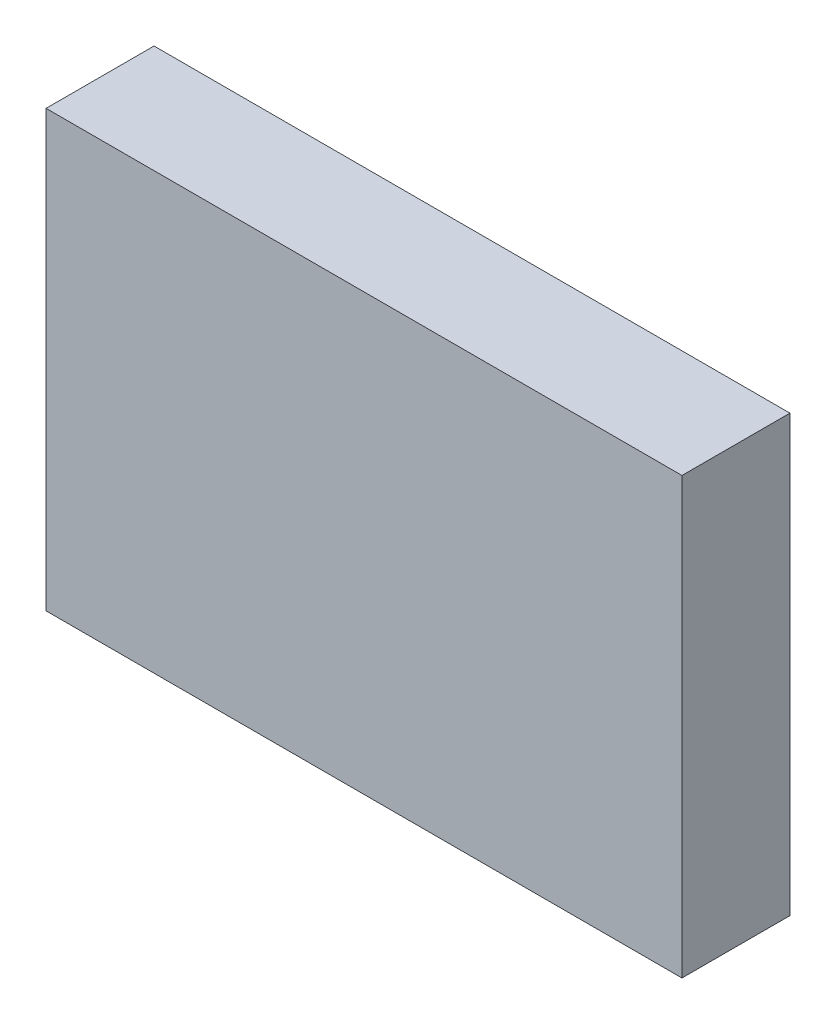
ISO-10303-21;
HEADER;
FILE_DESCRIPTION(('STEP AP214'),'2;1');
FILE_NAME('part.step','',(''),(''),'','','');
FILE_SCHEMA(('AUTOMOTIVE_DESIGN { 1 0 10303 214 1 1 1 1 }'));
ENDSEC;
DATA;
#1=APPLICATION_CONTEXT('core data for automotive mechanical design processes');
#2=APPLICATION_PROTOCOL_DEFINITION('international standard','automotive_design',2000,#1);
#3=PRODUCT_CONTEXT('',#1,'mechanical');
#4=PRODUCT('Part','Part','',(#3));
#5=PRODUCT_RELATED_PRODUCT_CATEGORY('part','',(#4));
#6=PRODUCT_DEFINITION_FORMATION('','',#4);
#7=PRODUCT_DEFINITION_CONTEXT('part definition',#1,'design');
#8=PRODUCT_DEFINITION('design','',#6,#7);
#9=PRODUCT_DEFINITION_SHAPE('','',#8);
#10=(LENGTH_UNIT() NAMED_UNIT(*) SI_UNIT(.MILLI.,.METRE.));
#11=(NAMED_UNIT(*) PLANE_ANGLE_UNIT() SI_UNIT($,.RADIAN.));
#12=(NAMED_UNIT(*) SI_UNIT($,.STERADIAN.) SOLID_ANGLE_UNIT());
#13=UNCERTAINTY_MEASURE_WITH_UNIT(LENGTH_MEASURE(1.E-05),#10,'distance_accuracy_value','');
#14=(GEOMETRIC_REPRESENTATION_CONTEXT(3) GLOBAL_UNCERTAINTY_ASSIGNED_CONTEXT((#13)) GLOBAL_UNIT_ASSIGNED_CONTEXT((#10,
#11,#12)) REPRESENTATION_CONTEXT('',''));
#15=CARTESIAN_POINT('',(0.,0.,0.));
#16=DIRECTION('',(0.,0.,1.));
#17=DIRECTION('',(1.,0.,0.));
#18=AXIS2_PLACEMENT_3D('',#15,#16,#17);
#19=CARTESIAN_POINT('',(-43.2247925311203,28.4432572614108,10.));
#20=DIRECTION('',(1.,0.,0.));
#21=DIRECTION('',(0.,0.,-1.));
#22=AXIS2_PLACEMENT_3D('',#19,#20,#21);
#23=PLANE('',#22);
#24=DIRECTION('',(0.,-1.,0.));
#25=VECTOR('',#24,1.);
#26=CARTESIAN_POINT('',(-43.2247925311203,28.4432572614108,0.));
#27=LINE('',#26,#25);
#28=CARTESIAN_POINT('',(-43.2247925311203,28.4432572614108,0.));
#29=VERTEX_POINT('',#28);
#30=CARTESIAN_POINT('',(-43.2247925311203,-11.870020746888,0.));
#31=VERTEX_POINT('',#30);
#32=EDGE_CURVE('E76',#29,#31,#27,.T.);
#33=ORIENTED_EDGE('',*,*,#32,.T.);
#34=DIRECTION('',(0.,0.,-1.));
#35=VECTOR('',#34,1.);
#36=CARTESIAN_POINT('',(-43.2247925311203,-11.870020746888,10.));
#37=LINE('',#36,#35);
#38=CARTESIAN_POINT('',(-43.2247925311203,-11.870020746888,10.));
#39=VERTEX_POINT('',#38);
#40=EDGE_CURVE('E11',#39,#31,#37,.T.);
#41=ORIENTED_EDGE('',*,*,#40,.F.);
#42=DIRECTION('',(0.,-1.,0.));
#43=VECTOR('',#42,1.);
#44=CARTESIAN_POINT('',(-43.2247925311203,28.4432572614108,10.));
#45=LINE('',#44,#43);
#46=CARTESIAN_POINT('',(-43.2247925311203,28.4432572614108,10.));
#47=VERTEX_POINT('',#46);
#48=EDGE_CURVE('E94',#47,#39,#45,.T.);
#49=ORIENTED_EDGE('',*,*,#48,.F.);
#50=DIRECTION('',(0.,0.,-1.));
#51=VECTOR('',#50,1.);
#52=CARTESIAN_POINT('',(-43.2247925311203,28.4432572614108,10.));
#53=LINE('',#52,#51);
#54=EDGE_CURVE('E88',#47,#29,#53,.T.);
#55=ORIENTED_EDGE('',*,*,#54,.T.);
#56=EDGE_LOOP('',(#33,#41,#49,#55));
#57=FACE_BOUND('',#56,.T.);
#58=ADVANCED_FACE('F32',(#57),#23,.F.);
#59=CARTESIAN_POINT('',(-43.2247925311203,-11.870020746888,10.));
#60=DIRECTION('',(0.,1.,0.));
#61=DIRECTION('',(0.,0.,1.));
#62=AXIS2_PLACEMENT_3D('',#59,#60,#61);
#63=PLANE('',#62);
#64=DIRECTION('',(1.,0.,0.));
#65=VECTOR('',#64,1.);
#66=CARTESIAN_POINT('',(-43.2247925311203,-11.870020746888,0.));
#67=LINE('',#66,#65);
#68=CARTESIAN_POINT('',(15.6773858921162,-11.870020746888,0.));
#69=VERTEX_POINT('',#68);
#70=EDGE_CURVE('E72',#31,#69,#67,.T.);
#71=ORIENTED_EDGE('',*,*,#70,.T.);
#72=DIRECTION('',(0.,0.,-1.));
#73=VECTOR('',#72,1.);
#74=CARTESIAN_POINT('',(15.6773858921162,-11.870020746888,10.));
#75=LINE('',#74,#73);
#76=CARTESIAN_POINT('',(15.6773858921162,-11.870020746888,10.));
#77=VERTEX_POINT('',#76);
#78=EDGE_CURVE('E39',#77,#69,#75,.T.);
#79=ORIENTED_EDGE('',*,*,#78,.F.);
#80=DIRECTION('',(1.,0.,0.));
#81=VECTOR('',#80,1.);
#82=CARTESIAN_POINT('',(-43.2247925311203,-11.870020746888,10.));
#83=LINE('',#82,#81);
#84=EDGE_CURVE('E84',#39,#77,#83,.T.);
#85=ORIENTED_EDGE('',*,*,#84,.F.);
#86=ORIENTED_EDGE('',*,*,#40,.T.);
#87=EDGE_LOOP('',(#71,#79,#85,#86));
#88=FACE_BOUND('',#87,.T.);
#89=ADVANCED_FACE('F83',(#88),#63,.F.);
#90=CARTESIAN_POINT('',(15.6773858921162,28.4432572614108,10.));
#91=DIRECTION('',(-1.,0.,0.));
#92=DIRECTION('',(0.,0.,1.));
#93=AXIS2_PLACEMENT_3D('',#90,#91,#92);
#94=PLANE('',#93);
#95=DIRECTION('',(0.,1.,0.));
#96=VECTOR('',#95,1.);
#97=CARTESIAN_POINT('',(15.6773858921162,28.4432572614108,0.));
#98=LINE('',#97,#96);
#99=CARTESIAN_POINT('',(15.6773858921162,28.4432572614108,0.));
#100=VERTEX_POINT('',#99);
#101=EDGE_CURVE('E77',#69,#100,#98,.T.);
#102=ORIENTED_EDGE('',*,*,#101,.T.);
#103=DIRECTION('',(0.,0.,-1.));
#104=VECTOR('',#103,1.);
#105=CARTESIAN_POINT('',(15.6773858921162,28.4432572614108,10.));
#106=LINE('',#105,#104);
#107=CARTESIAN_POINT('',(15.6773858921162,28.4432572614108,10.));
#108=VERTEX_POINT('',#107);
#109=EDGE_CURVE('E100',#108,#100,#106,.T.);
#110=ORIENTED_EDGE('',*,*,#109,.F.);
#111=DIRECTION('',(0.,1.,0.));
#112=VECTOR('',#111,1.);
#113=CARTESIAN_POINT('',(15.6773858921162,28.4432572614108,10.));
#114=LINE('',#113,#112);
#115=EDGE_CURVE('E51',#77,#108,#114,.T.);
#116=ORIENTED_EDGE('',*,*,#115,.F.);
#117=ORIENTED_EDGE('',*,*,#78,.T.);
#118=EDGE_LOOP('',(#102,#110,#116,#117));
#119=FACE_BOUND('',#118,.T.);
#120=ADVANCED_FACE('F103',(#119),#94,.F.);
#121=CARTESIAN_POINT('',(-43.2247925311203,28.4432572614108,10.));
#122=DIRECTION('',(0.,-1.,0.));
#123=DIRECTION('',(0.,0.,-1.));
#124=AXIS2_PLACEMENT_3D('',#121,#122,#123);
#125=PLANE('',#124);
#126=DIRECTION('',(-1.,0.,0.));
#127=VECTOR('',#126,1.);
#128=CARTESIAN_POINT('',(-43.2247925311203,28.4432572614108,0.));
#129=LINE('',#128,#127);
#130=EDGE_CURVE('E92',#100,#29,#129,.T.);
#131=ORIENTED_EDGE('',*,*,#130,.T.);
#132=ORIENTED_EDGE('',*,*,#54,.F.);
#133=DIRECTION('',(-1.,0.,0.));
#134=VECTOR('',#133,1.);
#135=CARTESIAN_POINT('',(-43.2247925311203,28.4432572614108,10.));
#136=LINE('',#135,#134);
#137=EDGE_CURVE('E46',#108,#47,#136,.T.);
#138=ORIENTED_EDGE('',*,*,#137,.F.);
#139=ORIENTED_EDGE('',*,*,#109,.T.);
#140=EDGE_LOOP('',(#131,#132,#138,#139));
#141=FACE_BOUND('',#140,.T.);
#142=ADVANCED_FACE('F105',(#141),#125,.F.);
#143=CARTESIAN_POINT('',(-43.2247925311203,-11.870020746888,10.));
#144=DIRECTION('',(0.,0.,1.));
#145=DIRECTION('',(1.,0.,0.));
#146=AXIS2_PLACEMENT_3D('',#143,#144,#145);
#147=PLANE('',#146);
#148=ORIENTED_EDGE('',*,*,#48,.T.);
#149=ORIENTED_EDGE('',*,*,#84,.T.);
#150=ORIENTED_EDGE('',*,*,#115,.T.);
#151=ORIENTED_EDGE('',*,*,#137,.T.);
#152=EDGE_LOOP('',(#148,#149,#150,#151));
#153=FACE_BOUND('',#152,.T.);
#154=ADVANCED_FACE('F106',(#153),#147,.T.);
#155=CARTESIAN_POINT('',(-43.2247925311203,-11.870020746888,0.));
#156=DIRECTION('',(0.,0.,1.));
#157=DIRECTION('',(1.,0.,0.));
#158=AXIS2_PLACEMENT_3D('',#155,#156,#157);
#159=PLANE('',#158);
#160=ORIENTED_EDGE('',*,*,#32,.F.);
#161=ORIENTED_EDGE('',*,*,#130,.F.);
#162=ORIENTED_EDGE('',*,*,#101,.F.);
#163=ORIENTED_EDGE('',*,*,#70,.F.);
#164=EDGE_LOOP('',(#160,#161,#162,#163));
#165=FACE_BOUND('',#164,.T.);
#166=ADVANCED_FACE('F73',(#165),#159,.F.);
#167=CLOSED_SHELL('',(#58,#89,#120,#142,#154,#166));
#168=MANIFOLD_SOLID_BREP('B2',#167);
#169=ADVANCED_BREP_SHAPE_REPRESENTATION('',(#18,#168),#14);
#170=SHAPE_DEFINITION_REPRESENTATION(#9,#169);
ENDSEC;
END-ISO-10303-21;
